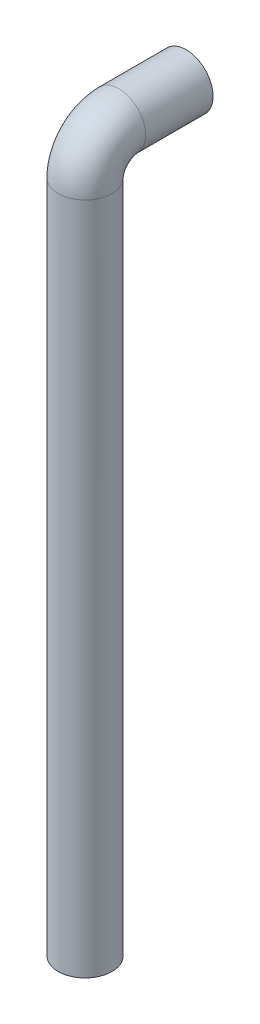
ISO-10303-21;
HEADER;
FILE_DESCRIPTION(('STEP AP214'),'2;1');
FILE_NAME('part.step','',(''),(''),'','','');
FILE_SCHEMA(('AUTOMOTIVE_DESIGN { 1 0 10303 214 1 1 1 1 }'));
ENDSEC;
DATA;
#1=APPLICATION_CONTEXT('core data for automotive mechanical design processes');
#2=APPLICATION_PROTOCOL_DEFINITION('international standard','automotive_design',2000,#1);
#3=PRODUCT_CONTEXT('',#1,'mechanical');
#4=PRODUCT('Part','Part','',(#3));
#5=PRODUCT_RELATED_PRODUCT_CATEGORY('part','',(#4));
#6=PRODUCT_DEFINITION_FORMATION('','',#4);
#7=PRODUCT_DEFINITION_CONTEXT('part definition',#1,'design');
#8=PRODUCT_DEFINITION('design','',#6,#7);
#9=PRODUCT_DEFINITION_SHAPE('','',#8);
#10=(LENGTH_UNIT() NAMED_UNIT(*) SI_UNIT(.MILLI.,.METRE.));
#11=(NAMED_UNIT(*) PLANE_ANGLE_UNIT() SI_UNIT($,.RADIAN.));
#12=(NAMED_UNIT(*) SI_UNIT($,.STERADIAN.) SOLID_ANGLE_UNIT());
#13=UNCERTAINTY_MEASURE_WITH_UNIT(LENGTH_MEASURE(1.E-05),#10,'distance_accuracy_value','');
#14=(GEOMETRIC_REPRESENTATION_CONTEXT(3) GLOBAL_UNCERTAINTY_ASSIGNED_CONTEXT((#13)) GLOBAL_UNIT_ASSIGNED_CONTEXT((#10,
#11,#12)) REPRESENTATION_CONTEXT('',''));
#15=CARTESIAN_POINT('',(0.,0.,0.));
#16=DIRECTION('',(0.,0.,1.));
#17=DIRECTION('',(1.,0.,0.));
#18=AXIS2_PLACEMENT_3D('',#15,#16,#17);
#19=CARTESIAN_POINT('',(-32.3087189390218,10.5,-4.0881473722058));
#20=DIRECTION('',(0.,-0.000968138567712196,-0.999999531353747));
#21=DIRECTION('',(0.,0.999999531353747,-0.000968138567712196));
#22=AXIS2_PLACEMENT_3D('',#19,#20,#21);
#23=PLANE('',#22);
#24=CARTESIAN_POINT('',(-32.3087189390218,10.8999998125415,-4.08853462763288));
#25=CARTESIAN_POINT('',(-32.2862636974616,10.8999979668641,-4.08853462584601));
#26=CARTESIAN_POINT('',(-32.2637880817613,10.8981019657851,-4.08853279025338));
#27=CARTESIAN_POINT('',(-32.2194364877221,10.8905590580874,-4.08852548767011));
#28=CARTESIAN_POINT('',(-32.1975618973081,10.8849041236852,-4.08852001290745));
#29=CARTESIAN_POINT('',(-32.1551093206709,10.8700118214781,-4.08850559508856));
#30=CARTESIAN_POINT('',(-32.1345290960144,10.8607808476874,-4.08849665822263));
#31=CARTESIAN_POINT('',(-32.0951816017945,10.8389813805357,-4.08847555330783));
#32=CARTESIAN_POINT('',(-32.0764169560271,10.82640815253,-4.08846338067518));
#33=CARTESIAN_POINT('',(-32.0412914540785,10.7983078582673,-4.08843617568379));
#34=CARTESIAN_POINT('',(-32.0249272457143,10.7827849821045,-4.08842114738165));
#35=CARTESIAN_POINT('',(-31.9950140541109,10.7491901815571,-4.08838862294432));
#36=CARTESIAN_POINT('',(-31.9814690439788,10.7311147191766,-4.08837112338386));
#37=CARTESIAN_POINT('',(-31.9576169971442,10.6929591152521,-4.08833418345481));
#38=CARTESIAN_POINT('',(-31.947307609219,10.6728804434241,-4.08831474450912));
#39=CARTESIAN_POINT('',(-31.9302054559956,10.6312760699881,-4.08827446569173));
#40=CARTESIAN_POINT('',(-31.9234128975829,10.6097502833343,-4.08825362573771));
#41=CARTESIAN_POINT('',(-31.9135383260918,10.565864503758,-4.08821113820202));
#42=CARTESIAN_POINT('',(-31.9104562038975,10.543504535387,-4.08818949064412));
#43=CARTESIAN_POINT('',(-31.9080896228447,10.4985845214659,-4.0881460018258));
#44=CARTESIAN_POINT('',(-31.9088051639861,10.4760244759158,-4.08812416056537));
#45=CARTESIAN_POINT('',(-31.9140136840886,10.4313440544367,-4.08808090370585));
#46=CARTESIAN_POINT('',(-31.9185067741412,10.4092236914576,-4.08805948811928));
#47=CARTESIAN_POINT('',(-31.9311425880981,10.3660525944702,-4.08801769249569));
#48=CARTESIAN_POINT('',(-31.9392850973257,10.3450017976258,-4.08799731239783));
#49=CARTESIAN_POINT('',(-31.95899582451,10.3045511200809,-4.08795815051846));
#50=CARTESIAN_POINT('',(-31.9705665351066,10.285152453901,-4.08793936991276));
#51=CARTESIAN_POINT('',(-31.9967840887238,10.2486004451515,-4.08790398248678));
#52=CARTESIAN_POINT('',(-32.01142660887,10.2314440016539,-4.08788737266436));
#53=CARTESIAN_POINT('',(-32.0434049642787,10.1998083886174,-4.08785674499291));
#54=CARTESIAN_POINT('',(-32.0607445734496,10.1853330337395,-4.08784273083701));
#55=CARTESIAN_POINT('',(-32.0975836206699,10.1595197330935,-4.08781773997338));
#56=CARTESIAN_POINT('',(-32.1170799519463,10.1481773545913,-4.08780675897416));
#57=CARTESIAN_POINT('',(-32.1577326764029,10.1289067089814,-4.08778810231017));
#58=CARTESIAN_POINT('',(-32.1788919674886,10.1209845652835,-4.08778043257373));
#59=CARTESIAN_POINT('',(-32.2222054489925,10.1088230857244,-4.08776865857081));
#60=CARTESIAN_POINT('',(-32.2443574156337,10.1045759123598,-4.08776454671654));
#61=CARTESIAN_POINT('',(-32.2806491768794,10.1007382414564,-4.08776083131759));
#62=CARTESIAN_POINT('',(-32.2946800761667,10.0999990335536,-4.08776011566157));
#63=CARTESIAN_POINT('',(-32.3311741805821,10.1000020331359,-4.08776011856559));
#64=CARTESIAN_POINT('',(-32.3536497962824,10.1018980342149,-4.08776195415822));
#65=CARTESIAN_POINT('',(-32.3980013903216,10.1094409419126,-4.08776925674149));
#66=CARTESIAN_POINT('',(-32.4198759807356,10.1150958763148,-4.08777473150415));
#67=CARTESIAN_POINT('',(-32.4623285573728,10.1299881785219,-4.08778914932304));
#68=CARTESIAN_POINT('',(-32.4829087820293,10.1392191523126,-4.08779808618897));
#69=CARTESIAN_POINT('',(-32.5222562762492,10.1610186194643,-4.08781919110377));
#70=CARTESIAN_POINT('',(-32.5410209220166,10.17359184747,-4.08783136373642));
#71=CARTESIAN_POINT('',(-32.5761464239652,10.2016921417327,-4.08785856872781));
#72=CARTESIAN_POINT('',(-32.5925106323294,10.2172150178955,-4.08787359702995));
#73=CARTESIAN_POINT('',(-32.6224238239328,10.2508098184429,-4.08790612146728));
#74=CARTESIAN_POINT('',(-32.6359688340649,10.2688852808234,-4.08792362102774));
#75=CARTESIAN_POINT('',(-32.6598208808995,10.307040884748,-4.08796056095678));
#76=CARTESIAN_POINT('',(-32.6701302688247,10.3271195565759,-4.08797999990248));
#77=CARTESIAN_POINT('',(-32.6872324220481,10.3687239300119,-4.08802027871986));
#78=CARTESIAN_POINT('',(-32.6940249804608,10.3902497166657,-4.08804111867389));
#79=CARTESIAN_POINT('',(-32.7038995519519,10.434135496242,-4.08808360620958));
#80=CARTESIAN_POINT('',(-32.7069816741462,10.456495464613,-4.08810525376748));
#81=CARTESIAN_POINT('',(-32.709348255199,10.5014154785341,-4.0881487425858));
#82=CARTESIAN_POINT('',(-32.7086327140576,10.5239755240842,-4.08817058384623));
#83=CARTESIAN_POINT('',(-32.7034241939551,10.5686559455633,-4.08821384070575));
#84=CARTESIAN_POINT('',(-32.6989311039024,10.5907763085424,-4.08823525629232));
#85=CARTESIAN_POINT('',(-32.6862952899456,10.6339474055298,-4.08827705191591));
#86=CARTESIAN_POINT('',(-32.678152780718,10.6549982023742,-4.08829743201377));
#87=CARTESIAN_POINT('',(-32.6584420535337,10.6954488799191,-4.08833659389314));
#88=CARTESIAN_POINT('',(-32.6468713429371,10.714847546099,-4.08835537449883));
#89=CARTESIAN_POINT('',(-32.6206537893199,10.7513995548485,-4.08839076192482));
#90=CARTESIAN_POINT('',(-32.6060112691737,10.7685559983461,-4.08840737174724));
#91=CARTESIAN_POINT('',(-32.574032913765,10.8001916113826,-4.08843799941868));
#92=CARTESIAN_POINT('',(-32.5566933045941,10.8146669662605,-4.08845201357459));
#93=CARTESIAN_POINT('',(-32.5198542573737,10.8404802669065,-4.08847700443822));
#94=CARTESIAN_POINT('',(-32.5003579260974,10.8518226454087,-4.08848798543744));
#95=CARTESIAN_POINT('',(-32.4597052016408,10.8710932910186,-4.08850664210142));
#96=CARTESIAN_POINT('',(-32.438545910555,10.8790154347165,-4.08851431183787));
#97=CARTESIAN_POINT('',(-32.3952324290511,10.8911769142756,-4.08852608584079));
#98=CARTESIAN_POINT('',(-32.37308046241,10.8954240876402,-4.08853019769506));
#99=CARTESIAN_POINT('',(-32.3367887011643,10.8992617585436,-4.08853391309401));
#100=CARTESIAN_POINT('',(-32.322757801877,10.9000009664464,-4.08853462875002));
#101=CARTESIAN_POINT('',(-32.3087189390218,10.8999998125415,-4.08853462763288));
#102=B_SPLINE_CURVE_WITH_KNOTS('',3,(#24,#25,#26,#27,#28,#29,#30,#31,#32,#33,#34,#35,#36,#37,
#38,#39,#40,#41,#42,#43,#44,#45,#46,#47,#48,#49,#50,#51,#52,#53,#54,#55,#56,#57,#58,#59,#60,#61,
#62,#63,#64,#65,#66,#67,#68,#69,#70,#71,#72,#73,#74,#75,#76,#77,#78,#79,#80,#81,#82,#83,#84,#85,
#86,#87,#88,#89,#90,#91,#92,#93,#94,#95,#96,#97,#98,#99,#100,#101),.UNSPECIFIED.,.T.,.F.,(4,2,2,
2,2,2,2,2,2,2,2,2,2,2,2,2,2,2,2,2,2,2,2,2,2,2,2,2,2,2,2,2,2,2,2,2,2,2,4),(0.,0.0673217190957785,
0.13478767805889,0.202133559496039,0.269575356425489,0.33692205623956,0.404363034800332,
0.471754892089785,0.539150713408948,0.606544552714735,0.673938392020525,0.741334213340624,
0.808726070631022,0.876167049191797,0.943513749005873,1.0109555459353,1.07830142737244,
1.14576738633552,1.21308910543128,1.25517818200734,1.32249990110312,1.38996586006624,
1.45731174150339,1.52475353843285,1.59210023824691,1.65954121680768,1.72693307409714,
1.7943288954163,1.8617227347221,1.92911657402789,1.99651239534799,2.06390425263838,
2.13134523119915,2.19869193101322,2.26613372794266,2.3334796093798,2.40094556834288,
2.46826728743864,2.51035636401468),.UNSPECIFIED.);
#103=CARTESIAN_POINT('',(-32.3087189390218,10.8999998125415,-4.08853462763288));
#104=VERTEX_POINT('',#103);
#105=EDGE_CURVE('E19',#104,#104,#102,.T.);
#106=ORIENTED_EDGE('',*,*,#105,.T.);
#107=EDGE_LOOP('',(#106));
#108=FACE_BOUND('',#107,.T.);
#109=ADVANCED_FACE('F15',(#108),#23,.T.);
#110=CARTESIAN_POINT('',(-32.3087189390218,10.8999998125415,-4.08853462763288));
#111=CARTESIAN_POINT('',(-32.3087189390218,10.8999998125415,-3.0880507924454));
#112=CARTESIAN_POINT('',(-31.5087189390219,10.8999998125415,-4.08853462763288));
#113=CARTESIAN_POINT('',(-31.5087189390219,10.8999998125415,-3.0880507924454));
#114=CARTESIAN_POINT('',(-31.5087189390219,10.1000001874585,-4.08776011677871));
#115=CARTESIAN_POINT('',(-31.5087189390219,10.1000001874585,-3.08727628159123));
#116=CARTESIAN_POINT('',(-32.3087189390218,10.1000001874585,-4.08776011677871));
#117=CARTESIAN_POINT('',(-32.3087189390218,10.1000001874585,-3.08727628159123));
#118=CARTESIAN_POINT('',(-33.1087189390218,10.1000001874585,-4.08776011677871));
#119=CARTESIAN_POINT('',(-33.1087189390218,10.1000001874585,-3.08727628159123));
#120=CARTESIAN_POINT('',(-33.1087189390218,10.8999998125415,-4.08853462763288));
#121=CARTESIAN_POINT('',(-33.1087189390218,10.8999998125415,-3.0880507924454));
#122=CARTESIAN_POINT('',(-32.3087189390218,10.8999998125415,-4.08853462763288));
#123=CARTESIAN_POINT('',(-32.3087189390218,10.8999998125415,-3.0880507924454));
#124=(BOUNDED_SURFACE() B_SPLINE_SURFACE(3,1,((#110,#111),(#112,#113),(#114,#115),(#116,#117),
(#118,#119),(#120,#121),(#122,#123)),.UNSPECIFIED.,.T.,.F.,.F.) B_SPLINE_SURFACE_WITH_KNOTS((4,
3,4),(2,2),(0.,0.5,1.),(0.,1.),
.UNSPECIFIED.) GEOMETRIC_REPRESENTATION_ITEM() RATIONAL_B_SPLINE_SURFACE(((1.,1.),
(0.333333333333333,0.333333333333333),(0.333333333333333,0.333333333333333),(1.,1.),
(0.333333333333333,0.333333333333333),(0.333333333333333,0.333333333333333),(1.,1.))) REPRESENTATION_ITEM('') SURFACE());
#125=CARTESIAN_POINT('',(-32.3087189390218,10.5,-3.08766353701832));
#126=DIRECTION('',(0.,-0.000968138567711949,-0.999999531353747));
#127=DIRECTION('',(0.,0.999999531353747,-0.00096813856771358));
#128=AXIS2_PLACEMENT_3D('',#125,#126,#127);
#129=CIRCLE('',#128,0.399999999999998);
#130=CARTESIAN_POINT('',(-32.3087189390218,10.8999998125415,-3.08805079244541));
#131=VERTEX_POINT('',#130);
#132=EDGE_CURVE('E30',#131,#131,#129,.T.);
#133=CARTESIAN_POINT('',(-32.3087189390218,10.8999998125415,-4.08853462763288));
#134=CARTESIAN_POINT('',(-32.3087189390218,10.8999998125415,-4.07811292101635));
#135=CARTESIAN_POINT('',(-32.3087189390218,10.8999998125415,-4.06769121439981));
#136=CARTESIAN_POINT('',(-32.3087189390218,10.8999998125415,-4.04684780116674));
#137=CARTESIAN_POINT('',(-32.3087189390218,10.8999998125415,-4.0364260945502));
#138=CARTESIAN_POINT('',(-32.3087189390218,10.8999998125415,-4.01558268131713));
#139=CARTESIAN_POINT('',(-32.3087189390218,10.8999998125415,-4.00516097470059));
#140=CARTESIAN_POINT('',(-32.3087189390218,10.8999998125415,-3.98431756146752));
#141=CARTESIAN_POINT('',(-32.3087189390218,10.8999998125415,-3.97389585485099));
#142=CARTESIAN_POINT('',(-32.3087189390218,10.8999998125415,-3.95305244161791));
#143=CARTESIAN_POINT('',(-32.3087189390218,10.8999998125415,-3.94263073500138));
#144=CARTESIAN_POINT('',(-32.3087189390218,10.8999998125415,-3.92178732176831));
#145=CARTESIAN_POINT('',(-32.3087189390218,10.8999998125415,-3.91136561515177));
#146=CARTESIAN_POINT('',(-32.3087189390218,10.8999998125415,-3.8905222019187));
#147=CARTESIAN_POINT('',(-32.3087189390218,10.8999998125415,-3.88010049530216));
#148=CARTESIAN_POINT('',(-32.3087189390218,10.8999998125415,-3.85925708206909));
#149=CARTESIAN_POINT('',(-32.3087189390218,10.8999998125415,-3.84883537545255));
#150=CARTESIAN_POINT('',(-32.3087189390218,10.8999998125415,-3.82799196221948));
#151=CARTESIAN_POINT('',(-32.3087189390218,10.8999998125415,-3.81757025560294));
#152=CARTESIAN_POINT('',(-32.3087189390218,10.8999998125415,-3.79672684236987));
#153=CARTESIAN_POINT('',(-32.3087189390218,10.8999998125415,-3.78630513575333));
#154=CARTESIAN_POINT('',(-32.3087189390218,10.8999998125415,-3.76546172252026));
#155=CARTESIAN_POINT('',(-32.3087189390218,10.8999998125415,-3.75504001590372));
#156=CARTESIAN_POINT('',(-32.3087189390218,10.8999998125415,-3.73419660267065));
#157=CARTESIAN_POINT('',(-32.3087189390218,10.8999998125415,-3.72377489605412));
#158=CARTESIAN_POINT('',(-32.3087189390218,10.8999998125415,-3.70293148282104));
#159=CARTESIAN_POINT('',(-32.3087189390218,10.8999998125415,-3.69250977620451));
#160=CARTESIAN_POINT('',(-32.3087189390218,10.8999998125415,-3.67166636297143));
#161=CARTESIAN_POINT('',(-32.3087189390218,10.8999998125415,-3.6612446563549));
#162=CARTESIAN_POINT('',(-32.3087189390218,10.8999998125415,-3.64040124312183));
#163=CARTESIAN_POINT('',(-32.3087189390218,10.8999998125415,-3.62997953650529));
#164=CARTESIAN_POINT('',(-32.3087189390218,10.8999998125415,-3.60913612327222));
#165=CARTESIAN_POINT('',(-32.3087189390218,10.8999998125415,-3.59871441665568));
#166=CARTESIAN_POINT('',(-32.3087189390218,10.8999998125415,-3.57787100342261));
#167=CARTESIAN_POINT('',(-32.3087189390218,10.8999998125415,-3.56744929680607));
#168=CARTESIAN_POINT('',(-32.3087189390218,10.8999998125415,-3.546605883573));
#169=CARTESIAN_POINT('',(-32.3087189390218,10.8999998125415,-3.53618417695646));
#170=CARTESIAN_POINT('',(-32.3087189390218,10.8999998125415,-3.51534076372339));
#171=CARTESIAN_POINT('',(-32.3087189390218,10.8999998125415,-3.50491905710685));
#172=CARTESIAN_POINT('',(-32.3087189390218,10.8999998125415,-3.48407564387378));
#173=CARTESIAN_POINT('',(-32.3087189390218,10.8999998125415,-3.47365393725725));
#174=CARTESIAN_POINT('',(-32.3087189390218,10.8999998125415,-3.45281052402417));
#175=CARTESIAN_POINT('',(-32.3087189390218,10.8999998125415,-3.44238881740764));
#176=CARTESIAN_POINT('',(-32.3087189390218,10.8999998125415,-3.42154540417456));
#177=CARTESIAN_POINT('',(-32.3087189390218,10.8999998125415,-3.41112369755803));
#178=CARTESIAN_POINT('',(-32.3087189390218,10.8999998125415,-3.39028028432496));
#179=CARTESIAN_POINT('',(-32.3087189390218,10.8999998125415,-3.37985857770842));
#180=CARTESIAN_POINT('',(-32.3087189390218,10.8999998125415,-3.35901516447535));
#181=CARTESIAN_POINT('',(-32.3087189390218,10.8999998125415,-3.34859345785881));
#182=CARTESIAN_POINT('',(-32.3087189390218,10.8999998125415,-3.32775004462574));
#183=CARTESIAN_POINT('',(-32.3087189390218,10.8999998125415,-3.3173283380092));
#184=CARTESIAN_POINT('',(-32.3087189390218,10.8999998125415,-3.29648492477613));
#185=CARTESIAN_POINT('',(-32.3087189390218,10.8999998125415,-3.28606321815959));
#186=CARTESIAN_POINT('',(-32.3087189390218,10.8999998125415,-3.26521980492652));
#187=CARTESIAN_POINT('',(-32.3087189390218,10.8999998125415,-3.25479809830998));
#188=CARTESIAN_POINT('',(-32.3087189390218,10.8999998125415,-3.23395468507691));
#189=CARTESIAN_POINT('',(-32.3087189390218,10.8999998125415,-3.22353297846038));
#190=CARTESIAN_POINT('',(-32.3087189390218,10.8999998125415,-3.2026895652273));
#191=CARTESIAN_POINT('',(-32.3087189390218,10.8999998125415,-3.19226785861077));
#192=CARTESIAN_POINT('',(-32.3087189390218,10.8999998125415,-3.17142444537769));
#193=CARTESIAN_POINT('',(-32.3087189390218,10.8999998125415,-3.16100273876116));
#194=CARTESIAN_POINT('',(-32.3087189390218,10.8999998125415,-3.14015932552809));
#195=CARTESIAN_POINT('',(-32.3087189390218,10.8999998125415,-3.12973761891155));
#196=CARTESIAN_POINT('',(-32.3087189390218,10.8999998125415,-3.10889420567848));
#197=CARTESIAN_POINT('',(-32.3087189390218,10.8999998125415,-3.09847249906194));
#198=CARTESIAN_POINT('',(-32.3087189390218,10.8999998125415,-3.0880507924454));
#199=B_SPLINE_CURVE_WITH_KNOTS('',3,(#133,#134,#135,#136,#137,#138,#139,#140,#141,#142,#143,
#144,#145,#146,#147,#148,#149,#150,#151,#152,#153,#154,#155,#156,#157,#158,#159,#160,#161,#162,
#163,#164,#165,#166,#167,#168,#169,#170,#171,#172,#173,#174,#175,#176,#177,#178,#179,#180,#181,
#182,#183,#184,#185,#186,#187,#188,#189,#190,#191,#192,#193,#194,#195,#196,#197,#198),
.UNSPECIFIED.,.F.,.F.,(4,2,2,2,2,2,2,2,2,2,2,2,2,2,2,2,2,2,2,2,2,2,2,2,2,2,2,2,2,2,2,2,4),(0.,
0.0312651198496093,0.0625302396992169,0.0937953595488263,0.125060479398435,0.156325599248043,
0.187590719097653,0.218855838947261,0.25012095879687,0.281386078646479,0.312651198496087,
0.343916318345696,0.375181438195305,0.406446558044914,0.437711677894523,0.468976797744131,
0.50024191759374,0.531507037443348,0.562772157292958,0.594037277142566,0.625302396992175,
0.656567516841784,0.687832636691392,0.719097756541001,0.75036287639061,0.781627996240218,
0.812893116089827,0.844158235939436,0.875423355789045,0.906688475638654,0.937953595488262,
0.969218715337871,1.00048383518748),.UNSPECIFIED.);
#200=EDGE_CURVE('BSEAM40',#104,#131,#199,.T.);
#201=ORIENTED_EDGE('',*,*,#105,.F.);
#202=ORIENTED_EDGE('',*,*,#132,.T.);
#203=ORIENTED_EDGE('',*,*,#200,.T.);
#204=ORIENTED_EDGE('',*,*,#200,.F.);
#205=EDGE_LOOP('',(#201,#203,#202,#204));
#206=FACE_BOUND('',#205,.T.);
#207=ADVANCED_FACE('F40',(#206),#124,.F.);
#208=CARTESIAN_POINT('',(-32.3087189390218,10.8999998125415,-3.08805079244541));
#209=CARTESIAN_POINT('',(-32.3087189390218,10.9002268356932,-2.56072182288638));
#210=CARTESIAN_POINT('',(-32.3087189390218,10.5273289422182,-2.1878638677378));
#211=CARTESIAN_POINT('',(-32.3087189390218,10.,-2.1881473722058));
#212=CARTESIAN_POINT('',(-31.5087189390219,10.8999998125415,-3.0880507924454));
#213=CARTESIAN_POINT('',(-31.5087189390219,10.9002268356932,-2.56072182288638));
#214=CARTESIAN_POINT('',(-31.5087189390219,10.5273289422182,-2.1878638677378));
#215=CARTESIAN_POINT('',(-31.5087189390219,10.,-2.1881473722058));
#216=CARTESIAN_POINT('',(-31.5087189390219,10.1000001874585,-3.08727628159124));
#217=CARTESIAN_POINT('',(-31.5087189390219,10.0997731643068,-3.0289360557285));
#218=CARTESIAN_POINT('',(-31.5087189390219,10.0583399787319,-2.98786386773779));
#219=CARTESIAN_POINT('',(-31.5087189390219,10.,-2.9881473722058));
#220=CARTESIAN_POINT('',(-32.3087189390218,10.1000001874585,-3.08727628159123));
#221=CARTESIAN_POINT('',(-32.3087189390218,10.0997731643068,-3.0289360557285));
#222=CARTESIAN_POINT('',(-32.3087189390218,10.0583399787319,-2.98786386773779));
#223=CARTESIAN_POINT('',(-32.3087189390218,10.,-2.9881473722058));
#224=CARTESIAN_POINT('',(-33.1087189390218,10.1000001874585,-3.08727628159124));
#225=CARTESIAN_POINT('',(-33.1087189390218,10.0997731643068,-3.0289360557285));
#226=CARTESIAN_POINT('',(-33.1087189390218,10.0583399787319,-2.98786386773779));
#227=CARTESIAN_POINT('',(-33.1087189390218,10.,-2.9881473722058));
#228=CARTESIAN_POINT('',(-33.1087189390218,10.8999998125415,-3.0880507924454));
#229=CARTESIAN_POINT('',(-33.1087189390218,10.9002268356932,-2.56072182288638));
#230=CARTESIAN_POINT('',(-33.1087189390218,10.5273289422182,-2.1878638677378));
#231=CARTESIAN_POINT('',(-33.1087189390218,10.,-2.1881473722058));
#232=CARTESIAN_POINT('',(-32.3087189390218,10.8999998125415,-3.08805079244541));
#233=CARTESIAN_POINT('',(-32.3087189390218,10.9002268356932,-2.56072182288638));
#234=CARTESIAN_POINT('',(-32.3087189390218,10.5273289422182,-2.1878638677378));
#235=CARTESIAN_POINT('',(-32.3087189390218,10.,-2.1881473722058));
#236=(BOUNDED_SURFACE() B_SPLINE_SURFACE(3,3,((#208,#209,#210,#211),(#212,#213,#214,#215),(#216,
#217,#218,#219),(#220,#221,#222,#223),(#224,#225,#226,#227),(#228,#229,#230,#231),(#232,#233,
#234,#235)),.UNSPECIFIED.,.T.,.F.,.F.) B_SPLINE_SURFACE_WITH_KNOTS((4,3,4),(4,4),(0.,0.5,1.),
(0.,1.),.UNSPECIFIED.) GEOMETRIC_REPRESENTATION_ITEM() RATIONAL_B_SPLINE_SURFACE(((1.,
0.80450960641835,0.80450960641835,1.),(0.333333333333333,0.268169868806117,0.268169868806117,
0.333333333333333),(0.333333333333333,0.268169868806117,0.268169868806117,0.333333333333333),
(1.,0.80450960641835,0.80450960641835,1.),(0.333333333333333,0.268169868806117,
0.268169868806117,0.333333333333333),(0.333333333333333,0.268169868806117,0.268169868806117,
0.333333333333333),(1.,0.80450960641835,0.80450960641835,1.))) REPRESENTATION_ITEM('') SURFACE());
#237=CARTESIAN_POINT('',(-32.3087189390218,10.,-2.5881473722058));
#238=DIRECTION('',(0.,-1.,0.));
#239=DIRECTION('',(0.,0.,-1.));
#240=AXIS2_PLACEMENT_3D('',#237,#238,#239);
#241=CIRCLE('',#240,0.399999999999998);
#242=CARTESIAN_POINT('',(-32.3087189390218,10.,-2.1881473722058));
#243=VERTEX_POINT('',#242);
#244=EDGE_CURVE('E26',#243,#243,#241,.T.);
#245=CARTESIAN_POINT('',(-32.3087189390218,10.8999998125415,-3.08805079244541));
#246=CARTESIAN_POINT('',(-32.3087189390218,10.9000012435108,-3.084728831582));
#247=CARTESIAN_POINT('',(-32.3087189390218,10.8999842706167,-3.08140686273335));
#248=CARTESIAN_POINT('',(-32.3087189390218,10.8999133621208,-3.07474823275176));
#249=CARTESIAN_POINT('',(-32.3087189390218,10.8998592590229,-3.07141157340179));
#250=CARTESIAN_POINT('',(-32.3087189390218,10.8997135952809,-3.06472408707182));
#251=CARTESIAN_POINT('',(-32.3087189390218,10.8996218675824,-3.06137326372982));
#252=CARTESIAN_POINT('',(-32.3087189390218,10.8994004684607,-3.05465798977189));
#253=CARTESIAN_POINT('',(-32.3087189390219,10.8992706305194,-3.0512935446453));
#254=CARTESIAN_POINT('',(-32.3087189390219,10.8989725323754,-3.04455158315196));
#255=CARTESIAN_POINT('',(-32.3087189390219,10.8988041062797,-3.04117407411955));
#256=CARTESIAN_POINT('',(-32.3087189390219,10.8984283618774,-3.03440655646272));
#257=CARTESIAN_POINT('',(-32.3087189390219,10.8982208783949,-3.03101655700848));
#258=CARTESIAN_POINT('',(-32.3087189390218,10.8977665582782,-3.02422464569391));
#259=CARTESIAN_POINT('',(-32.3087189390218,10.8975195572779,-3.02082274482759));
#260=CARTESIAN_POINT('',(-32.3087189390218,10.8969857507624,-3.01400763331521));
#261=CARTESIAN_POINT('',(-32.3087189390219,10.8966987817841,-3.01059443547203));
#262=CARTESIAN_POINT('',(-32.3087189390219,10.8960845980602,-3.00375734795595));
#263=CARTESIAN_POINT('',(-32.3087189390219,10.8957572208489,-3.00033347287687));
#264=CARTESIAN_POINT('',(-32.3087189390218,10.895061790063,-2.99347566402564));
#265=CARTESIAN_POINT('',(-32.3087189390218,10.8946935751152,-2.99004174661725));
#266=CARTESIAN_POINT('',(-32.3087189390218,10.8939160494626,-2.98316450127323));
#267=CARTESIAN_POINT('',(-32.3087189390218,10.8935065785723,-2.97972119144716));
#268=CARTESIAN_POINT('',(-32.3087189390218,10.8926461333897,-2.9728258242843));
#269=CARTESIAN_POINT('',(-32.3087189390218,10.8921950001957,-2.96937378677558));
#270=CARTESIAN_POINT('',(-32.3087189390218,10.8912508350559,-2.96246164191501));
#271=CARTESIAN_POINT('',(-32.3087189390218,10.8907576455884,-2.95900155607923));
#272=CARTESIAN_POINT('',(-32.3087189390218,10.8897289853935,-2.95207400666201));
#273=CARTESIAN_POINT('',(-32.3087189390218,10.8891933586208,-2.94860656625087));
#274=CARTESIAN_POINT('',(-32.3087189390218,10.8880794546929,-2.94166501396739));
#275=CARTESIAN_POINT('',(-32.3087189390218,10.8875010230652,-2.93819092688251));
#276=CARTESIAN_POINT('',(-32.3087189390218,10.8863011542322,-2.93123680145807));
#277=CARTESIAN_POINT('',(-32.3087189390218,10.8856795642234,-2.92775678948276));
#278=CARTESIAN_POINT('',(-32.3087189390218,10.8843930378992,-2.920791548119));
#279=CARTESIAN_POINT('',(-32.3087189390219,10.8837279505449,-2.91730634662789));
#280=CARTESIAN_POINT('',(-32.3087189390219,10.8823541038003,-2.91033147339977));
#281=CARTESIAN_POINT('',(-32.3087189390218,10.881645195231,-2.90684183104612));
#282=CARTESIAN_POINT('',(-32.3087189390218,10.8801833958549,-2.89985883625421));
#283=CARTESIAN_POINT('',(-32.3087189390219,10.8794303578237,-2.89636551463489));
#284=CARTESIAN_POINT('',(-32.3087189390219,10.8778800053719,-2.88937593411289));
#285=CARTESIAN_POINT('',(-32.3087189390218,10.8770825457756,-2.88587970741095));
#286=CARTESIAN_POINT('',(-32.3087189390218,10.8754430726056,-2.87888510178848));
#287=CARTESIAN_POINT('',(-32.3087189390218,10.8746009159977,-2.87538675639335));
#288=CARTESIAN_POINT('',(-32.3087189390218,10.8728717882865,-2.86838871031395));
#289=CARTESIAN_POINT('',(-32.3087189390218,10.8719846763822,-2.8648890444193));
#290=CARTESIAN_POINT('',(-32.3087189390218,10.8701653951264,-2.85788916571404));
#291=CARTESIAN_POINT('',(-32.3087189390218,10.8692330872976,-2.85438898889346));
#292=CARTESIAN_POINT('',(-32.3087189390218,10.8673231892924,-2.84738890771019));
#293=CARTESIAN_POINT('',(-32.3087189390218,10.8663454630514,-2.84388904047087));
#294=CARTESIAN_POINT('',(-32.3087189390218,10.8643445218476,-2.8368904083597));
#295=CARTESIAN_POINT('',(-32.3087189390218,10.8633211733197,-2.83339168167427));
#296=CARTESIAN_POINT('',(-32.3087189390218,10.8612288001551,-2.82639617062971));
#297=CARTESIAN_POINT('',(-32.3087189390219,10.8601596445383,-2.82289942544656));
#298=CARTESIAN_POINT('',(-32.3087189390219,10.8579754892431,-2.8159087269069));
#299=CARTESIAN_POINT('',(-32.3087189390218,10.856860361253,-2.81241481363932));
#300=CARTESIAN_POINT('',(-32.3087189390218,10.8545841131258,-2.80543063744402));
#301=CARTESIAN_POINT('',(-32.3087189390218,10.8534228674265,-2.80194041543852));
#302=CARTESIAN_POINT('',(-32.3087189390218,10.8510542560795,-2.79496448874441));
#303=CARTESIAN_POINT('',(-32.3087189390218,10.8498467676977,-2.79147882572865));
#304=CARTESIAN_POINT('',(-32.3087189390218,10.8473855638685,-2.78451289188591));
#305=CARTESIAN_POINT('',(-32.3087189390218,10.8461317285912,-2.78103266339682));
#306=CARTESIAN_POINT('',(-32.3087189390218,10.8435777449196,-2.7740784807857));
#307=CARTESIAN_POINT('',(-32.3087189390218,10.842277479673,-2.77060456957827));
#308=CARTESIAN_POINT('',(-32.3087189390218,10.8396305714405,-2.76366391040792));
#309=CARTESIAN_POINT('',(-32.3087189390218,10.8382838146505,-2.76019720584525));
#310=CARTESIAN_POINT('',(-32.3087189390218,10.8355438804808,-2.75327185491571));
#311=CARTESIAN_POINT('',(-32.3087189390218,10.8341505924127,-2.74981325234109));
#312=CARTESIAN_POINT('',(-32.3087189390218,10.8313175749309,-2.74290500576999));
#313=CARTESIAN_POINT('',(-32.3087189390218,10.8298777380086,-2.73945540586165));
#314=CARTESIAN_POINT('',(-32.3087189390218,10.8269516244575,-2.73256606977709));
#315=CARTESIAN_POINT('',(-32.3087189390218,10.8254652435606,-2.72912637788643));
#316=CARTESIAN_POINT('',(-32.3087189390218,10.8224460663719,-2.72225776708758));
#317=CARTESIAN_POINT('',(-32.3087189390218,10.8209131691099,-2.71882889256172));
#318=CARTESIAN_POINT('',(-32.3087189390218,10.8178010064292,-2.71198282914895));
#319=CARTESIAN_POINT('',(-32.3087189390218,10.8162216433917,-2.70856568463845));
#320=CARTESIAN_POINT('',(-32.3087189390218,10.8130166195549,-2.70174399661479));
#321=CARTESIAN_POINT('',(-32.3087189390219,10.8113908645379,-2.69833949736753));
#322=CARTESIAN_POINT('',(-32.3087189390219,10.8080931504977,-2.69154401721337));
#323=CARTESIAN_POINT('',(-32.3087189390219,10.8064211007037,-2.68815308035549));
#324=CARTESIAN_POINT('',(-32.3087189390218,10.8030309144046,-2.68138564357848));
#325=CARTESIAN_POINT('',(-32.3087189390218,10.8013126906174,-2.67800918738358));
#326=CARTESIAN_POINT('',(-32.3087189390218,10.7978302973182,-2.67127163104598));
#327=CARTESIAN_POINT('',(-32.3087189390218,10.7960660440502,-2.66791057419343));
#328=CARTESIAN_POINT('',(-32.3087189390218,10.7924917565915,-2.66120473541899));
#329=CARTESIAN_POINT('',(-32.3087189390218,10.7906816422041,-2.65785999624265));
#330=CARTESIAN_POINT('',(-32.3087189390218,10.7870158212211,-2.65118771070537));
#331=CARTESIAN_POINT('',(-32.3087189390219,10.7851600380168,-2.64786020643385));
#332=CARTESIAN_POINT('',(-32.3087189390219,10.7814030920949,-2.64122330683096));
#333=CARTESIAN_POINT('',(-32.3087189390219,10.7795018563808,-2.63791395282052));
#334=CARTESIAN_POINT('',(-32.3087189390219,10.7756542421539,-2.63131426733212));
#335=CARTESIAN_POINT('',(-32.3087189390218,10.7737077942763,-2.62802397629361));
#336=CARTESIAN_POINT('',(-32.3087189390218,10.769770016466,-2.62146332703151));
#337=CARTESIAN_POINT('',(-32.3087189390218,10.7677786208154,-2.61819300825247));
#338=CARTESIAN_POINT('',(-32.3087189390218,10.7637512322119,-2.61167320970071));
#339=CARTESIAN_POINT('',(-32.3087189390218,10.761715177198,-2.60842376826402));
#340=CARTESIAN_POINT('',(-32.3087189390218,10.7575987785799,-2.60194662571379));
#341=CARTESIAN_POINT('',(-32.3087189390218,10.7555183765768,-2.59871896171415));
#342=CARTESIAN_POINT('',(-32.3087189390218,10.7513136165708,-2.59228626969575));
#343=CARTESIAN_POINT('',(-32.3087189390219,10.7491892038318,-2.58908127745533));
#344=CARTESIAN_POINT('',(-32.3087189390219,10.7448967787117,-2.5826948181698));
#345=CARTESIAN_POINT('',(-32.3087189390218,10.7427287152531,-2.57951338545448));
#346=CARTESIAN_POINT('',(-32.3087189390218,10.7383493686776,-2.57317492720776));
#347=CARTESIAN_POINT('',(-32.3087189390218,10.7361380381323,-2.57001793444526));
#348=CARTESIAN_POINT('',(-32.3087189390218,10.731672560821,-2.56372923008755));
#349=CARTESIAN_POINT('',(-32.3087189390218,10.7294183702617,-2.56059754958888));
#350=CARTESIAN_POINT('',(-32.3087189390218,10.7248675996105,-2.55436033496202));
#351=CARTESIAN_POINT('',(-32.3087189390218,10.7225709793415,-2.55125483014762));
#352=CARTESIAN_POINT('',(-32.3087189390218,10.7179357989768,-2.54507082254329));
#353=CARTESIAN_POINT('',(-32.3087189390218,10.7155972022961,-2.54199234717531));
#354=CARTESIAN_POINT('',(-32.3087189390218,10.710878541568,-2.53586324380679));
#355=CARTESIAN_POINT('',(-32.3087189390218,10.7084984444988,-2.53281264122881));
#356=CARTESIAN_POINT('',(-32.3087189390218,10.703697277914,-2.52674011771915));
#357=CARTESIAN_POINT('',(-32.3087189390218,10.7012761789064,-2.52371822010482));
#358=CARTESIAN_POINT('',(-32.3087189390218,10.6963935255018,-2.51770392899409));
#359=CARTESIAN_POINT('',(-32.3087189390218,10.6939319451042,-2.51471155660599));
#360=CARTESIAN_POINT('',(-32.3087189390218,10.6889688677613,-2.50875712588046));
#361=CARTESIAN_POINT('',(-32.3087189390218,10.6864673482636,-2.50579508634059));
#362=CARTESIAN_POINT('',(-32.3087189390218,10.6814249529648,-2.49990211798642));
#363=CARTESIAN_POINT('',(-32.3087189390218,10.6788840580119,-2.49697120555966));
#364=CARTESIAN_POINT('',(-32.3087189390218,10.6737634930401,-2.49114127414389));
#365=CARTESIAN_POINT('',(-32.3087189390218,10.6711838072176,-2.48824226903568));
#366=CARTESIAN_POINT('',(-32.3087189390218,10.6659862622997,-2.48247692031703));
#367=CARTESIAN_POINT('',(-32.3087189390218,10.663368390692,-2.47961058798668));
#368=CARTESIAN_POINT('',(-32.3087189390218,10.658095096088,-2.47391133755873));
#369=CARTESIAN_POINT('',(-32.3087189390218,10.6554396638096,-2.47107842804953));
#370=CARTESIAN_POINT('',(-32.3087189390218,10.6500918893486,-2.4654467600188));
#371=CARTESIAN_POINT('',(-32.3087189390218,10.6473995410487,-2.46264800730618));
#372=CARTESIAN_POINT('',(-32.3087189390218,10.6419785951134,-2.45708537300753));
#373=CARTESIAN_POINT('',(-32.3087189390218,10.639249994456,-2.45432149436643));
#374=CARTESIAN_POINT('',(-32.3087189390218,10.6337572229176,-2.44882931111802));
#375=CARTESIAN_POINT('',(-32.3087189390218,10.6309930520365,-2.4461010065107));
#376=CARTESIAN_POINT('',(-32.3087189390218,10.6254298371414,-2.44068065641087));
#377=CARTESIAN_POINT('',(-32.3087189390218,10.622630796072,-2.43798860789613));
#378=CARTESIAN_POINT('',(-32.3087189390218,10.6169985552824,-2.43264143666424));
#379=CARTESIAN_POINT('',(-32.3087189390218,10.6141653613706,-2.4299863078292));
#380=CARTESIAN_POINT('',(-32.3087189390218,10.6084655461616,-2.42471362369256));
#381=CARTESIAN_POINT('',(-32.3087189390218,10.6055989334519,-2.42209605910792));
#382=CARTESIAN_POINT('',(-32.3087189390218,10.599833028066,-2.41689913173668));
#383=CARTESIAN_POINT('',(-32.3087189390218,10.5969337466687,-2.41431975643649));
#384=CARTESIAN_POINT('',(-32.3087189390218,10.5911032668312,-2.40919981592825));
#385=CARTESIAN_POINT('',(-32.3087189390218,10.5881720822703,-2.40665923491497));
#386=CARTESIAN_POINT('',(-32.3087189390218,10.5822785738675,-2.40161747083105));
#387=CARTESIAN_POINT('',(-32.3087189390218,10.5793162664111,-2.39911626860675));
#388=CARTESIAN_POINT('',(-32.3087189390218,10.5733613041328,-2.39415382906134));
#389=CARTESIAN_POINT('',(-32.3087189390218,10.5703686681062,-2.39169256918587));
#390=CARTESIAN_POINT('',(-32.3087189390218,10.5643538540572,-2.38681055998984));
#391=CARTESIAN_POINT('',(-32.3087189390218,10.5613316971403,-2.38438978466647));
#392=CARTESIAN_POINT('',(-32.3087189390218,10.5552586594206,-2.37958926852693));
#393=CARTESIAN_POINT('',(-32.3087189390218,10.552207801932,-2.37720949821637));
#394=CARTESIAN_POINT('',(-32.3087189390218,10.5460781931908,-2.37249149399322));
#395=CARTESIAN_POINT('',(-32.3087189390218,10.5429994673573,-2.37015322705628));
#396=CARTESIAN_POINT('',(-32.3087189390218,10.5368149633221,-2.36551870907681));
#397=CARTESIAN_POINT('',(-32.3087189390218,10.5337092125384,-2.36322242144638));
#398=CARTESIAN_POINT('',(-32.3087189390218,10.5274715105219,-2.35867231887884));
#399=CARTESIAN_POINT('',(-32.3087189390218,10.5243395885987,-2.3564184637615));
#400=CARTESIAN_POINT('',(-32.3087189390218,10.5180504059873,-2.35195366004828));
#401=CARTESIAN_POINT('',(-32.3087189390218,10.514893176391,-2.34974266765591));
#402=CARTESIAN_POINT('',(-32.3087189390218,10.5085542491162,-2.34536400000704));
#403=CARTESIAN_POINT('',(-32.3087189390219,10.5053725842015,-2.34319627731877));
#404=CARTESIAN_POINT('',(-32.3087189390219,10.4989856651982,-2.3389045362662));
#405=CARTESIAN_POINT('',(-32.3087189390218,10.4957804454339,-2.33678046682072));
#406=CARTESIAN_POINT('',(-32.3087189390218,10.4893473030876,-2.33257639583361));
#407=CARTESIAN_POINT('',(-32.3087189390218,10.4861194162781,-2.33049633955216));
#408=CARTESIAN_POINT('',(-32.3087189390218,10.4796418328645,-2.32638063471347));
#409=CARTESIAN_POINT('',(-32.3087189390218,10.4763921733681,-2.32434492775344));
#410=CARTESIAN_POINT('',(-32.3087189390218,10.4698719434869,-2.32031823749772));
#411=CARTESIAN_POINT('',(-32.3087189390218,10.4666014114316,-2.31832719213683));
#412=CARTESIAN_POINT('',(-32.3087189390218,10.4600403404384,-2.31439011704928));
#413=CARTESIAN_POINT('',(-32.3087189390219,10.456749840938,-2.31244402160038));
#414=CARTESIAN_POINT('',(-32.3087189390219,10.450149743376,-2.30859711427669));
#415=CARTESIAN_POINT('',(-32.3087189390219,10.4468401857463,-2.30669623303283));
#416=CARTESIAN_POINT('',(-32.3087189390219,10.4402028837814,-2.30293999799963));
#417=CARTESIAN_POINT('',(-32.3087189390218,10.4368751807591,-2.30108457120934));
#418=CARTESIAN_POINT('',(-32.3087189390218,10.4302025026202,-2.29741946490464));
#419=CARTESIAN_POINT('',(-32.3087189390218,10.4268575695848,-2.295609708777));
#420=CARTESIAN_POINT('',(-32.3087189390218,10.4201513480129,-2.29203613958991));
#421=CARTESIAN_POINT('',(-32.3087189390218,10.4167901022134,-2.29027224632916));
#422=CARTESIAN_POINT('',(-32.3087189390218,10.4100521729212,-2.28679057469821));
#423=CARTESIAN_POINT('',(-32.3087189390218,10.4066755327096,-2.28507271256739));
#424=CARTESIAN_POINT('',(-32.3087189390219,10.3999077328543,-2.28168325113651));
#425=CARTESIAN_POINT('',(-32.3087189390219,10.3965166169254,-2.28001156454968));
#426=CARTESIAN_POINT('',(-32.3087189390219,10.3897207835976,-2.27671457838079));
#427=CARTESIAN_POINT('',(-32.3087189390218,10.386316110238,-2.27508918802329));
#428=CARTESIAN_POINT('',(-32.3087189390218,10.3794940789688,-2.27188489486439));
#429=CARTESIAN_POINT('',(-32.3087189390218,10.376076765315,-2.27030589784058));
#430=CARTESIAN_POINT('',(-32.3087189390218,10.3692303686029,-2.26719446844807));
#431=CARTESIAN_POINT('',(-32.3087189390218,10.3658013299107,-2.2656619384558));
#432=CARTESIAN_POINT('',(-32.3087189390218,10.3589323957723,-2.26264349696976));
#433=CARTESIAN_POINT('',(-32.3087189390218,10.3554925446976,-2.261157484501));
#434=CARTESIAN_POINT('',(-32.3087189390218,10.3486028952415,-2.25823210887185));
#435=CARTESIAN_POINT('',(-32.3087189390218,10.3451531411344,-2.25679264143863));
#436=CARTESIAN_POINT('',(-32.3087189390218,10.3382445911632,-2.25396036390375));
#437=CARTESIAN_POINT('',(-32.3087189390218,10.3347858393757,-2.2525674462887));
#438=CARTESIAN_POINT('',(-32.3087189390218,10.3278601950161,-2.24982825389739));
#439=CARTESIAN_POINT('',(-32.3087189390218,10.3243933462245,-2.24848186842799));
#440=CARTESIAN_POINT('',(-32.3087189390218,10.3174524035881,-2.24583570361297));
#441=CARTESIAN_POINT('',(-32.3087189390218,10.3139783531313,-2.24453581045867));
#442=CARTESIAN_POINT('',(-32.3087189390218,10.3070238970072,-2.24198257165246));
#443=CARTESIAN_POINT('',(-32.3087189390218,10.3035435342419,-2.24072910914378));
#444=CARTESIAN_POINT('',(-32.3087189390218,10.2965773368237,-2.23826865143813));
#445=CARTESIAN_POINT('',(-32.3087189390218,10.2930915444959,-2.23706153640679));
#446=CARTESIAN_POINT('',(-32.3087189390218,10.2861153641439,-2.23469367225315));
#447=CARTESIAN_POINT('',(-32.3087189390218,10.2826250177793,-2.23353280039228));
#448=CARTESIAN_POINT('',(-32.3087189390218,10.275640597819,-2.23125730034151));
#449=CARTESIAN_POINT('',(-32.3087189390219,10.272146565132,-2.23014254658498));
#450=CARTESIAN_POINT('',(-32.3087189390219,10.2651556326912,-2.22795914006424));
#451=CARTESIAN_POINT('',(-32.3087189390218,10.2616587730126,-2.22689035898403));
#452=CARTESIAN_POINT('',(-32.3087189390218,10.2546630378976,-2.22479873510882));
#453=CARTESIAN_POINT('',(-32.3087189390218,10.2511642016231,-2.22377576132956));
#454=CARTESIAN_POINT('',(-32.3087189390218,10.2441653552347,-2.22177556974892));
#455=CARTESIAN_POINT('',(-32.3087189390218,10.2406653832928,-2.22079821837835));
#456=CARTESIAN_POINT('',(-32.3087189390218,10.2336650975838,-2.21888907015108));
#457=CARTESIAN_POINT('',(-32.3087189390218,10.2301648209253,-2.21795713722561));
#458=CARTESIAN_POINT('',(-32.3087189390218,10.2231647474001,-2.21613860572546));
#459=CARTESIAN_POINT('',(-32.3087189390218,10.2196649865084,-2.21525186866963));
#460=CARTESIAN_POINT('',(-32.3087189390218,10.2126667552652,-2.21352349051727));
#461=CARTESIAN_POINT('',(-32.3087189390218,10.2091683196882,-2.2126817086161));
#462=CARTESIAN_POINT('',(-32.3087189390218,10.2021735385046,-2.21104298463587));
#463=CARTESIAN_POINT('',(-32.3087189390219,10.1986772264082,-2.21024589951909));
#464=CARTESIAN_POINT('',(-32.3087189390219,10.1916874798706,-2.20869629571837));
#465=CARTESIAN_POINT('',(-32.3087189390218,10.1881940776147,-2.20794363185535));
#466=CARTESIAN_POINT('',(-32.3087189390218,10.181210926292,-2.20648258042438));
#467=CARTESIAN_POINT('',(-32.3087189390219,10.1777212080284,-2.20577404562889));
#468=CARTESIAN_POINT('',(-32.3087189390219,10.1707461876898,-2.20440094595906));
#469=CARTESIAN_POINT('',(-32.3087189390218,10.1672609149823,-2.20373623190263));
#470=CARTESIAN_POINT('',(-32.3087189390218,10.1602955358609,-2.20245045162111));
#471=CARTESIAN_POINT('',(-32.3087189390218,10.1568154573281,-2.20182923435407));
#472=CARTESIAN_POINT('',(-32.3087189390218,10.1498612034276,-2.20063011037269));
#473=CARTESIAN_POINT('',(-32.3087189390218,10.1463870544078,-2.20005205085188));
#474=CARTESIAN_POINT('',(-32.3087189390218,10.1394453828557,-2.1989388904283));
#475=CARTESIAN_POINT('',(-32.3087189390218,10.1359778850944,-2.19840363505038));
#476=CARTESIAN_POINT('',(-32.3087189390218,10.1290502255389,-2.19737571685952));
#477=CARTESIAN_POINT('',(-32.3087189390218,10.1255900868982,-2.1968828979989));
#478=CARTESIAN_POINT('',(-32.3087189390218,10.1186778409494,-2.19593947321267));
#479=CARTESIAN_POINT('',(-32.3087189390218,10.1152257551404,-2.19548870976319));
#480=CARTESIAN_POINT('',(-32.3087189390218,10.1083302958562,-2.19462900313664));
#481=CARTESIAN_POINT('',(-32.3087189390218,10.1048869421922,-2.19421990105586));
#482=CARTESIAN_POINT('',(-32.3087189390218,10.0980096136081,-2.19344311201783));
#483=CARTESIAN_POINT('',(-32.3087189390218,10.0945756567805,-2.19307526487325));
#484=CARTESIAN_POINT('',(-32.3087189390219,10.0877177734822,-2.19238056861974));
#485=CARTESIAN_POINT('',(-32.3087189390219,10.084293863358,-2.19205355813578));
#486=CARTESIAN_POINT('',(-32.3087189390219,10.0774567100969,-2.19144010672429));
#487=CARTESIAN_POINT('',(-32.3087189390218,10.0740434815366,-2.19115350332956));
#488=CARTESIAN_POINT('',(-32.3087189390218,10.0672283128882,-2.19062042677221));
#489=CARTESIAN_POINT('',(-32.3087189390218,10.0638263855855,-2.19037379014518));
#490=CARTESIAN_POINT('',(-32.3087189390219,10.0570344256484,-2.18992019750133));
#491=CARTESIAN_POINT('',(-32.3087189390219,10.0536444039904,-2.18971307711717));
#492=CARTESIAN_POINT('',(-32.3087189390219,10.0468768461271,-2.1893380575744));
#493=CARTESIAN_POINT('',(-32.3087189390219,10.0434993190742,-2.18916999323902));
#494=CARTESIAN_POINT('',(-32.3087189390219,10.0367573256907,-2.18887261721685));
#495=CARTESIAN_POINT('',(-32.3087189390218,10.0333928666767,-2.18874313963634));
#496=CARTESIAN_POINT('',(-32.3087189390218,10.0266775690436,-2.18852245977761));
#497=CARTESIAN_POINT('',(-32.3087189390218,10.023326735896,-2.18843109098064));
#498=CARTESIAN_POINT('',(-32.3087189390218,10.0166392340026,-2.1882861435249));
#499=CARTESIAN_POINT('',(-32.3087189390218,10.0133025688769,-2.18823239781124));
#500=CARTESIAN_POINT('',(-32.3087189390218,10.0066439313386,-2.18816220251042));
#501=CARTESIAN_POINT('',(-32.3087189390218,10.0033219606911,-2.18814558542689));
#502=CARTESIAN_POINT('',(-32.3087189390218,10.,-2.1881473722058));
#503=B_SPLINE_CURVE_WITH_KNOTS('',3,(#245,#246,#247,#248,#249,#250,#251,#252,#253,#254,#255,
#256,#257,#258,#259,#260,#261,#262,#263,#264,#265,#266,#267,#268,#269,#270,#271,#272,#273,#274,
#275,#276,#277,#278,#279,#280,#281,#282,#283,#284,#285,#286,#287,#288,#289,#290,#291,#292,#293,
#294,#295,#296,#297,#298,#299,#300,#301,#302,#303,#304,#305,#306,#307,#308,#309,#310,#311,#312,
#313,#314,#315,#316,#317,#318,#319,#320,#321,#322,#323,#324,#325,#326,#327,#328,#329,#330,#331,
#332,#333,#334,#335,#336,#337,#338,#339,#340,#341,#342,#343,#344,#345,#346,#347,#348,#349,#350,
#351,#352,#353,#354,#355,#356,#357,#358,#359,#360,#361,#362,#363,#364,#365,#366,#367,#368,#369,
#370,#371,#372,#373,#374,#375,#376,#377,#378,#379,#380,#381,#382,#383,#384,#385,#386,#387,#388,
#389,#390,#391,#392,#393,#394,#395,#396,#397,#398,#399,#400,#401,#402,#403,#404,#405,#406,#407,
#408,#409,#410,#411,#412,#413,#414,#415,#416,#417,#418,#419,#420,#421,#422,#423,#424,#425,#426,
#427,#428,#429,#430,#431,#432,#433,#434,#435,#436,#437,#438,#439,#440,#441,#442,#443,#444,#445,
#446,#447,#448,#449,#450,#451,#452,#453,#454,#455,#456,#457,#458,#459,#460,#461,#462,#463,#464,
#465,#466,#467,#468,#469,#470,#471,#472,#473,#474,#475,#476,#477,#478,#479,#480,#481,#482,#483,
#484,#485,#486,#487,#488,#489,#490,#491,#492,#493,#494,#495,#496,#497,#498,#499,#500,#501,#502),
.UNSPECIFIED.,.F.,.F.,(4,2,2,2,2,2,2,2,2,2,2,2,2,2,2,2,2,2,2,2,2,2,2,2,2,2,2,2,2,2,2,2,2,2,2,2,
2,2,2,2,2,2,2,2,2,2,2,2,2,2,2,2,2,2,2,2,2,2,2,2,2,2,2,2,2,2,2,2,2,2,2,2,2,2,2,2,2,2,2,2,2,2,2,2,
2,2,2,2,2,2,2,2,2,2,2,2,2,2,2,2,2,2,2,2,2,2,2,2,2,2,2,2,2,2,2,2,2,2,2,2,2,2,2,2,2,2,2,2,4),(0.,
0.00996583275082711,0.0199769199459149,0.0300329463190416,0.0401335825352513,0.0502784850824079,
0.0604672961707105,0.0706996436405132,0.0809751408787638,0.0912933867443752,0.101653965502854,
0.112056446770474,0.122500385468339,0.132985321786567,0.143510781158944,0.154076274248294,
0.164681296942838,0.175325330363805,0.186007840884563,0.196728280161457,0.207486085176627,
0.218280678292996,0.229111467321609,0.239977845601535,0.250879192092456,0.261814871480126,
0.272784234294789,0.283786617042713,0.294821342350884,0.305887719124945,0.316985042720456,
0.328112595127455,0.339269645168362,0.35045544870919,0.361669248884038,0.372910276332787,
0.384177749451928,0.395470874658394,0.406788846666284,0.41813084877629,0.429496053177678,
0.44088362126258,0.452292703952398,0.463722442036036,0.4751719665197,0.486640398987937,
0.498126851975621,0.509630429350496,0.521150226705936,0.532685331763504,0.544234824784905,
0.555797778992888,0.567373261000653,0.57896033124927,0.59055804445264,0.602165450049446,
0.613781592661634,0.625405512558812,0.63703624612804,0.648672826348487,0.660314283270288,
0.671959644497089,0.683607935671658,0.695258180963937,0.706909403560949,0.718560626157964,
0.730210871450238,0.741859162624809,0.753504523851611,0.765145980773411,0.776782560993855,
0.788413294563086,0.800037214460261,0.81165335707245,0.823260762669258,0.834858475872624,
0.846445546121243,0.858021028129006,0.869583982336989,0.881133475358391,0.89266858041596,
0.904188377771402,0.915691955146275,0.927178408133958,0.938646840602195,0.950096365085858,
0.961526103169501,0.97293518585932,0.984322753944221,0.995687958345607,1.00702996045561,
1.0183479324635,1.02964105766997,1.04090853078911,1.05214955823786,1.06336335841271,
1.07454916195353,1.08570621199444,1.09683376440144,1.10793108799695,1.11899746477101,
1.13003219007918,1.14103457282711,1.15200393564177,1.16293961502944,1.17384096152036,
1.18470733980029,1.1955381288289,1.20633272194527,1.21709052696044,1.22781096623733,
1.23849347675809,1.24913751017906,1.2597425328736,1.27030802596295,1.28083348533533,
1.29131842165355,1.30176236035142,1.31216484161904,1.32252542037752,1.33284366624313,
1.34311916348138,1.35335151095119,1.36354032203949,1.37368522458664,1.38378586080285,
1.39384188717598,1.40385297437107,1.4138188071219),.UNSPECIFIED.);
#504=EDGE_CURVE('BSEAM42',#131,#243,#503,.T.);
#505=ORIENTED_EDGE('',*,*,#132,.F.);
#506=ORIENTED_EDGE('',*,*,#244,.F.);
#507=ORIENTED_EDGE('',*,*,#504,.T.);
#508=ORIENTED_EDGE('',*,*,#504,.F.);
#509=EDGE_LOOP('',(#505,#507,#506,#508));
#510=FACE_BOUND('',#509,.T.);
#511=ADVANCED_FACE('F42',(#510),#236,.F.);
#512=CARTESIAN_POINT('',(-32.3087189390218,0.,-2.5881473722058));
#513=DIRECTION('',(0.,1.,0.));
#514=DIRECTION('',(0.,0.,1.));
#515=AXIS2_PLACEMENT_3D('',#512,#513,#514);
#516=PLANE('',#515);
#517=CARTESIAN_POINT('',(-32.3087189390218,0.,-2.5881473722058));
#518=DIRECTION('',(0.,-1.,0.));
#519=DIRECTION('',(0.,0.,-1.));
#520=AXIS2_PLACEMENT_3D('',#517,#518,#519);
#521=CIRCLE('',#520,0.399999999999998);
#522=CARTESIAN_POINT('',(-32.3087189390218,0.,-2.9881473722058));
#523=VERTEX_POINT('',#522);
#524=EDGE_CURVE('E10',#523,#523,#521,.F.);
#525=ORIENTED_EDGE('',*,*,#524,.F.);
#526=EDGE_LOOP('',(#525));
#527=FACE_BOUND('',#526,.T.);
#528=ADVANCED_FACE('F48',(#527),#516,.F.);
#529=CARTESIAN_POINT('',(-32.3087189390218,10.,-2.5881473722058));
#530=DIRECTION('',(0.,-1.,0.));
#531=DIRECTION('',(0.,0.,-1.));
#532=AXIS2_PLACEMENT_3D('',#529,#530,#531);
#533=CYLINDRICAL_SURFACE('',#532,0.399999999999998);
#534=ORIENTED_EDGE('',*,*,#524,.T.);
#535=EDGE_LOOP('',(#534));
#536=FACE_BOUND('',#535,.T.);
#537=ORIENTED_EDGE('',*,*,#244,.T.);
#538=EDGE_LOOP('',(#537));
#539=FACE_BOUND('',#538,.T.);
#540=ADVANCED_FACE('F54',(#536,#539),#533,.T.);
#541=CLOSED_SHELL('',(#109,#207,#511,#528,#540));
#542=MANIFOLD_SOLID_BREP('B1',#541);
#543=ADVANCED_BREP_SHAPE_REPRESENTATION('',(#18,#542),#14);
#544=SHAPE_DEFINITION_REPRESENTATION(#9,#543);
ENDSEC;
END-ISO-10303-21;
